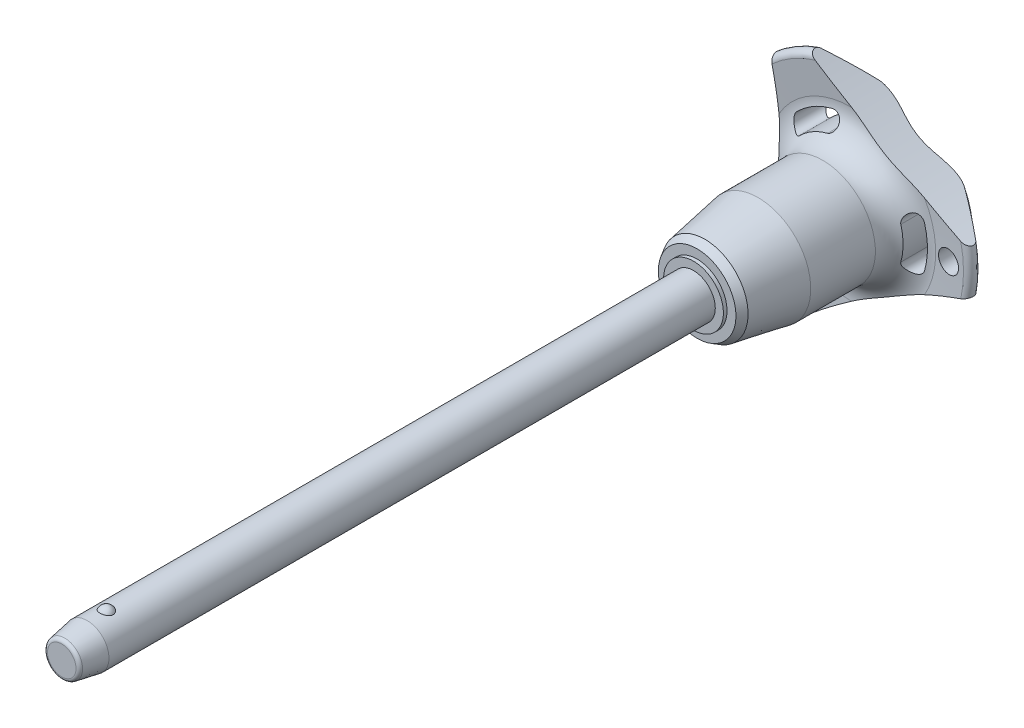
from build123d import *

# Parameters (mm, degrees)
SKETCH1_R           = 3
BOSS_EXTRUDE1_DEPTH = 80
SKETCH2_R           = 2.5
BOSS_EXTRUDE2_DEPTH = 26.7
BOSS_EXTRUDE3_START = 7
SKETCH1_2_R         = 3
BOSS_EXTRUDE3_DEPTH = 7
CHAMFER1_SIZE       = 3.5
CHAMFER1_SIZE2      = 0.617144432
FILLET1_R           = 0.5
SKETCH6_R           = 79.96
CUT_EXTRUDE1_DEPTH  = 110.252773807
CIRPATTERN1_COUNT   = 3
SKETCH7_R           = 1.5
CUT_EXTRUDE2_DEPTH  = 110.113366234


with BuildPart() as part:
    # Sketch1 → Boss-Extrude1 (new body)
    with BuildSketch(Plane.XY):
        Circle(SKETCH1_R)
    extrude(amount=-BOSS_EXTRUDE1_DEPTH)

    # Sketch2 → Boss-Extrude2 (add)
    with BuildSketch(Plane(origin=(0, 0, -80), x_dir=(-1, 0, 0), z_dir=(0, 0, -1))):
        Circle(SKETCH2_R)
    extrude(amount=BOSS_EXTRUDE2_DEPTH)

    # Sketch3 → Revolve1 (revolve)
    with BuildSketch(Plane(origin=(0, 0, 0), x_dir=(0, 0, -1), z_dir=(1, 0, 0))):
        with BuildLine():
            Line((-0.866025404, 3.5), (-0.866025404, 1.5))
            ThreePointArc((-0.866025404, 1.5), (0.133974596, 2.5), (-0.866025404, 3.5))
        make_face()
        with BuildLine():
            Line((-0.866025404, -1.5), (-0.866025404, -3.5))
            ThreePointArc((-0.866025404, -3.5), (0.133974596, -2.5), (-0.866025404, -1.5))
        make_face()
    revolve(axis=Axis((0, -1.5, 0.866025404), (0, 1, 0)))

    # Sketch1_2 → Boss-Extrude3 (add)
    with BuildSketch(Plane.XY.offset(BOSS_EXTRUDE3_START)):
        Circle(SKETCH1_2_R)
    extrude(amount=-BOSS_EXTRUDE3_DEPTH)

    # Chamfer1
    chamfer1_edges = [part.edges().sort_by_distance(p)[0] for p in [
        (-3, 0, 7),
    ]]
    chamfer1_side = [part.faces().sort_by_distance(p)[0] for p in [
        (-3, 0, -36.5),
    ]]
    chamfer(chamfer1_edges, length=CHAMFER1_SIZE, length2=CHAMFER1_SIZE2, reference=chamfer1_side[0])

    # Fillet1
    fillet1_edges = [part.edges().sort_by_distance(p)[0] for p in [
        (-2.382855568, 0, 7),
        (2.5, 0, -106.7),
    ]]
    fillet(fillet1_edges, radius=FILLET1_R)

    # Sketch4 → Revolve2 (revolve)
    with BuildSketch(Plane(origin=(0, 0, 0), x_dir=(0, 0, -1), z_dir=(1, 0, 0)), mode=Mode.PRIVATE) as revolve2_sk:
        Polygon((80, 0), (80, 4.118359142), (80.5, 4.118359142), (80.5, 5.343400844), (81.560917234, 5.955921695), (88.9, 7.25), (97.8, 7.25), (97.8, 0), align=None)
    revolve(revolve2_sk.sketch.rotate(Axis((0, 0, -97.8), (0, 0, 1)), 90), axis=Axis((0, 0, -97.8), (0, 0, 1)))

    # Sketch5 → Revolve3 (revolve)
    with BuildSketch(Plane(origin=(0, 0, 0), x_dir=(0, 0, -1), z_dir=(1, 0, 0)), mode=Mode.PRIVATE) as revolve3_sk:
        with BuildLine():
            Line((101.78715932, 11.570250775), (101.452568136, 15.735949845))
            ThreePointArc((101.452568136, 15.735949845), (101.946485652, 16.540188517), (102.862835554, 16.314230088))
            Line((102.862835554, 16.314230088), (106.326414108, 12.186497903))
            ThreePointArc((106.326414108, 12.186497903), (106.7, 11.109282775), (106.261488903, 10.056825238))
            ThreePointArc((106.261488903, 10.056825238), (103.289873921, 5.413681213), (102.25, 0))
            Line((102.25, 0), (97.8, 0))
            Line((97.8, 0), (97.8, 7.25))
            ThreePointArc((97.8, 7.25), (100.739473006, 8.537160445), (101.78715932, 11.570250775))
        make_face()
    revolve(revolve3_sk.sketch.rotate(Axis((0, 0, -102.25), (0, 0, 1)), 90), axis=Axis((0, 0, -102.25), (0, 0, 1)))

    # Sketch6 → Cut-Extrude1 (cut, through all)
    with BuildSketch(Plane.XY):
        with Locations((-89.76, 0)):
            Circle(SKETCH6_R)
        with BuildLine():
            ThreePointArc((10.099921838, -2.834717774), (10.490188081, 0), (10.099921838, 2.834717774))
            ThreePointArc((10.099921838, 2.834717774), (8.768180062, 3.582738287), (8.020159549, 2.250996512))
            ThreePointArc((8.020159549, 2.250996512), (8.330062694, 0), (8.020159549, -2.250996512))
            ThreePointArc((8.020159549, -2.250996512), (8.768180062, -3.582738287), (10.099921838, -2.834717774))
        make_face()
    cut_extrude1 = extrude(amount=-CUT_EXTRUDE1_DEPTH, mode=Mode.SUBTRACT)

    # CirPattern1: Cut-Extrude1 ×3 about axis
    cirpattern1_axis = Axis((0, 0, 0), (0, 0, 1))
    for i in range(1, CIRPATTERN1_COUNT):
        add(cut_extrude1.rotate(cirpattern1_axis, i * 360 / CIRPATTERN1_COUNT), mode=Mode.SUBTRACT)

    # Sketch7 → Cut-Extrude2 (cut, through all)
    with BuildSketch(Plane.XY):
        with Locations(Location((13.490188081, 0, 0), (0, 0, 225.221865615))):
            Circle(SKETCH7_R)
    extrude(amount=-CUT_EXTRUDE2_DEPTH, mode=Mode.SUBTRACT)


solid = part.part
